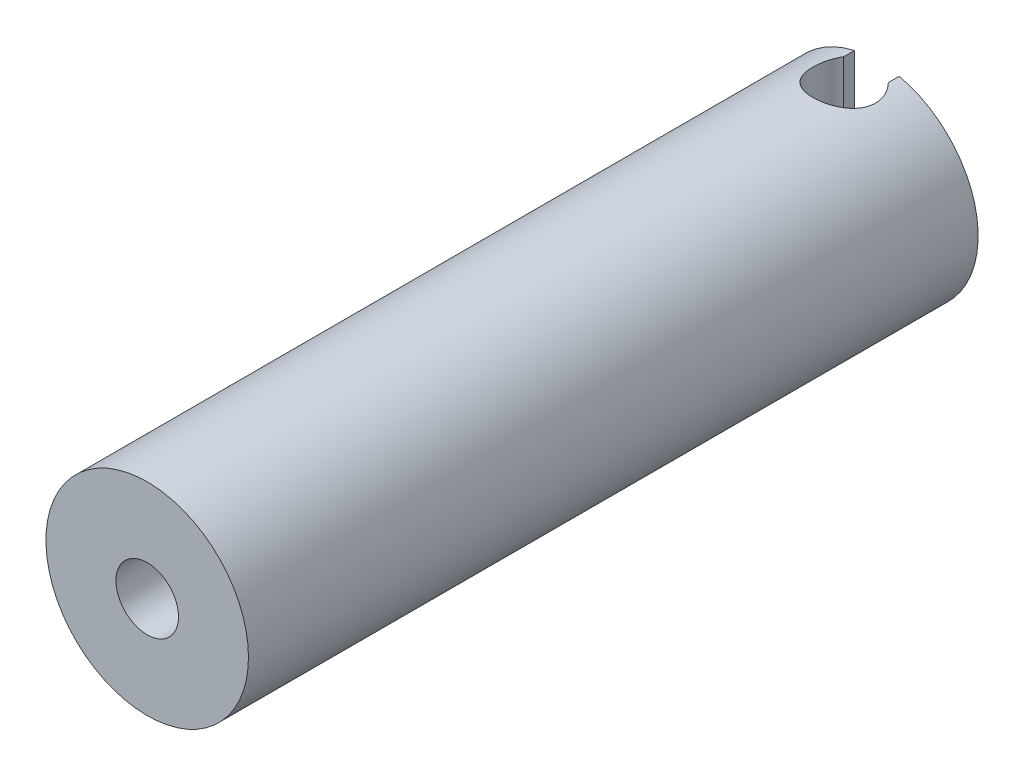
ISO-10303-21;
HEADER;
FILE_DESCRIPTION(('STEP AP214'),'2;1');
FILE_NAME('part.step','',(''),(''),'','','');
FILE_SCHEMA(('AUTOMOTIVE_DESIGN { 1 0 10303 214 1 1 1 1 }'));
ENDSEC;
DATA;
#1=APPLICATION_CONTEXT('core data for automotive mechanical design processes');
#2=APPLICATION_PROTOCOL_DEFINITION('international standard','automotive_design',2000,#1);
#3=PRODUCT_CONTEXT('',#1,'mechanical');
#4=PRODUCT('Part','Part','',(#3));
#5=PRODUCT_RELATED_PRODUCT_CATEGORY('part','',(#4));
#6=PRODUCT_DEFINITION_FORMATION('','',#4);
#7=PRODUCT_DEFINITION_CONTEXT('part definition',#1,'design');
#8=PRODUCT_DEFINITION('design','',#6,#7);
#9=PRODUCT_DEFINITION_SHAPE('','',#8);
#10=(LENGTH_UNIT() NAMED_UNIT(*) SI_UNIT(.MILLI.,.METRE.));
#11=(NAMED_UNIT(*) PLANE_ANGLE_UNIT() SI_UNIT($,.RADIAN.));
#12=(NAMED_UNIT(*) SI_UNIT($,.STERADIAN.) SOLID_ANGLE_UNIT());
#13=UNCERTAINTY_MEASURE_WITH_UNIT(LENGTH_MEASURE(1.E-05),#10,'distance_accuracy_value','');
#14=(GEOMETRIC_REPRESENTATION_CONTEXT(3) GLOBAL_UNCERTAINTY_ASSIGNED_CONTEXT((#13)) GLOBAL_UNIT_ASSIGNED_CONTEXT((#10,
#11,#12)) REPRESENTATION_CONTEXT('',''));
#15=CARTESIAN_POINT('',(0.,0.,0.));
#16=DIRECTION('',(0.,0.,1.));
#17=DIRECTION('',(1.,0.,0.));
#18=AXIS2_PLACEMENT_3D('',#15,#16,#17);
#19=CARTESIAN_POINT('',(0.,0.,0.));
#20=DIRECTION('',(0.,0.,1.));
#21=DIRECTION('',(1.,0.,0.));
#22=AXIS2_PLACEMENT_3D('',#19,#20,#21);
#23=PLANE('',#22);
#24=CARTESIAN_POINT('',(0.,0.,0.));
#25=DIRECTION('',(0.,0.,1.));
#26=DIRECTION('',(1.,0.,0.));
#27=AXIS2_PLACEMENT_3D('',#24,#25,#26);
#28=CIRCLE('',#27,6.8);
#29=CARTESIAN_POINT('',(1.5,-6.63249575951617,0.));
#30=VERTEX_POINT('',#29);
#31=CARTESIAN_POINT('',(1.5,6.63249575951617,0.));
#32=VERTEX_POINT('',#31);
#33=EDGE_CURVE('E134',#30,#32,#28,.T.);
#34=ORIENTED_EDGE('',*,*,#33,.F.);
#35=DIRECTION('',(0.,-1.,0.));
#36=VECTOR('',#35,1.);
#37=CARTESIAN_POINT('',(1.5,-8.51038839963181,0.));
#38=LINE('',#37,#36);
#39=CARTESIAN_POINT('',(1.5,-1.46969384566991,0.));
#40=VERTEX_POINT('',#39);
#41=EDGE_CURVE('E202',#40,#30,#38,.T.);
#42=ORIENTED_EDGE('',*,*,#41,.F.);
#43=CARTESIAN_POINT('',(0.,0.,0.));
#44=DIRECTION('',(0.,0.,1.));
#45=DIRECTION('',(1.,0.,0.));
#46=AXIS2_PLACEMENT_3D('',#43,#44,#45);
#47=CIRCLE('',#46,2.1);
#48=CARTESIAN_POINT('',(1.5,1.46969384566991,0.));
#49=VERTEX_POINT('',#48);
#50=EDGE_CURVE('E135',#40,#49,#47,.T.);
#51=ORIENTED_EDGE('',*,*,#50,.T.);
#52=EDGE_CURVE('E201',#32,#49,#38,.T.);
#53=ORIENTED_EDGE('',*,*,#52,.F.);
#54=EDGE_LOOP('',(#34,#42,#51,#53));
#55=FACE_BOUND('',#54,.T.);
#56=ADVANCED_FACE('F33',(#55),#23,.F.);
#57=CARTESIAN_POINT('',(0.,0.,0.));
#58=DIRECTION('',(0.,0.,1.));
#59=DIRECTION('',(1.,0.,0.));
#60=AXIS2_PLACEMENT_3D('',#57,#58,#59);
#61=CYLINDRICAL_SURFACE('',#60,2.1);
#62=CARTESIAN_POINT('',(0.,0.,2.2));
#63=DIRECTION('',(0.,0.707106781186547,0.707106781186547));
#64=DIRECTION('',(0.,-0.707106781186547,0.707106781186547));
#65=AXIS2_PLACEMENT_3D('',#62,#63,#64);
#66=ELLIPSE('',#65,2.9698484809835,2.1);
#67=CARTESIAN_POINT('',(1.84661853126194,1.,1.2));
#68=VERTEX_POINT('',#67);
#69=CARTESIAN_POINT('',(1.5,1.46969384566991,0.730306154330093));
#70=VERTEX_POINT('',#69);
#71=EDGE_CURVE('E161',#68,#70,#66,.T.);
#72=ORIENTED_EDGE('',*,*,#71,.T.);
#73=DIRECTION('',(0.,0.,1.));
#74=VECTOR('',#73,1.);
#75=CARTESIAN_POINT('',(1.5,1.46969384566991,0.));
#76=LINE('',#75,#74);
#77=EDGE_CURVE('E179',#70,#49,#76,.F.);
#78=ORIENTED_EDGE('',*,*,#77,.T.);
#79=ORIENTED_EDGE('',*,*,#50,.F.);
#80=DIRECTION('',(0.,0.,1.));
#81=VECTOR('',#80,1.);
#82=CARTESIAN_POINT('',(1.5,-1.46969384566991,0.));
#83=LINE('',#82,#81);
#84=CARTESIAN_POINT('',(1.5,-1.46969384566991,1.5));
#85=VERTEX_POINT('',#84);
#86=EDGE_CURVE('E189',#40,#85,#83,.T.);
#87=ORIENTED_EDGE('',*,*,#86,.T.);
#88=CARTESIAN_POINT('',(0.,0.,1.5));
#89=DIRECTION('',(0.,0.,-1.));
#90=DIRECTION('',(-1.,0.,0.));
#91=AXIS2_PLACEMENT_3D('',#88,#89,#90);
#92=CIRCLE('',#91,2.1);
#93=CARTESIAN_POINT('',(-1.5,-1.46969384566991,1.5));
#94=VERTEX_POINT('',#93);
#95=EDGE_CURVE('E129',#94,#85,#92,.F.);
#96=ORIENTED_EDGE('',*,*,#95,.F.);
#97=DIRECTION('',(0.,0.,1.));
#98=VECTOR('',#97,1.);
#99=CARTESIAN_POINT('',(-1.5,-1.46969384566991,0.));
#100=LINE('',#99,#98);
#101=CARTESIAN_POINT('',(-1.5,-1.46969384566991,0.));
#102=VERTEX_POINT('',#101);
#103=EDGE_CURVE('E111',#94,#102,#100,.F.);
#104=ORIENTED_EDGE('',*,*,#103,.T.);
#105=CARTESIAN_POINT('',(-1.5,1.46969384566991,0.));
#106=VERTEX_POINT('',#105);
#107=EDGE_CURVE('E127',#106,#102,#47,.T.);
#108=ORIENTED_EDGE('',*,*,#107,.F.);
#109=DIRECTION('',(0.,0.,1.));
#110=VECTOR('',#109,1.);
#111=CARTESIAN_POINT('',(-1.5,1.46969384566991,0.));
#112=LINE('',#111,#110);
#113=CARTESIAN_POINT('',(-1.5,1.46969384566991,0.730306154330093));
#114=VERTEX_POINT('',#113);
#115=EDGE_CURVE('E197',#106,#114,#112,.T.);
#116=ORIENTED_EDGE('',*,*,#115,.T.);
#117=CARTESIAN_POINT('',(-1.84661853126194,1.,1.2));
#118=VERTEX_POINT('',#117);
#119=EDGE_CURVE('E160',#114,#118,#66,.T.);
#120=ORIENTED_EDGE('',*,*,#119,.T.);
#121=DIRECTION('',(0.,0.,1.));
#122=VECTOR('',#121,1.);
#123=CARTESIAN_POINT('',(-1.84661853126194,1.,0.));
#124=LINE('',#123,#122);
#125=CARTESIAN_POINT('',(-1.84661853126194,1.,3.2));
#126=VERTEX_POINT('',#125);
#127=EDGE_CURVE('E163',#126,#118,#124,.F.);
#128=ORIENTED_EDGE('',*,*,#127,.F.);
#129=CARTESIAN_POINT('',(0.,0.,2.2));
#130=DIRECTION('',(0.,-0.707106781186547,0.707106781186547));
#131=DIRECTION('',(0.,0.707106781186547,0.707106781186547));
#132=AXIS2_PLACEMENT_3D('',#129,#130,#131);
#133=ELLIPSE('',#132,2.9698484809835,2.1);
#134=CARTESIAN_POINT('',(1.84661853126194,1.,3.2));
#135=VERTEX_POINT('',#134);
#136=EDGE_CURVE('E157',#126,#135,#133,.F.);
#137=ORIENTED_EDGE('',*,*,#136,.T.);
#138=DIRECTION('',(0.,0.,1.));
#139=VECTOR('',#138,1.);
#140=CARTESIAN_POINT('',(1.84661853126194,1.,0.));
#141=LINE('',#140,#139);
#142=EDGE_CURVE('E154',#68,#135,#141,.T.);
#143=ORIENTED_EDGE('',*,*,#142,.F.);
#144=EDGE_LOOP('',(#72,#78,#79,#87,#96,#104,#108,#116,#120,#128,#137,#143));
#145=FACE_BOUND('',#144,.T.);
#146=CARTESIAN_POINT('',(0.,0.,49.));
#147=DIRECTION('',(0.,0.,1.));
#148=DIRECTION('',(1.,0.,0.));
#149=AXIS2_PLACEMENT_3D('',#146,#147,#148);
#150=CIRCLE('',#149,2.1);
#151=CARTESIAN_POINT('',(2.1,0.,49.));
#152=VERTEX_POINT('',#151);
#153=EDGE_CURVE('E141',#152,#152,#150,.T.);
#154=ORIENTED_EDGE('',*,*,#153,.T.);
#155=EDGE_LOOP('',(#154));
#156=FACE_BOUND('',#155,.T.);
#157=ADVANCED_FACE('F124',(#145,#156),#61,.F.);
#158=CARTESIAN_POINT('',(0.,0.,49.));
#159=DIRECTION('',(0.,0.,-1.));
#160=DIRECTION('',(-1.,0.,0.));
#161=AXIS2_PLACEMENT_3D('',#158,#159,#160);
#162=CYLINDRICAL_SURFACE('',#161,6.8);
#163=ORIENTED_EDGE('',*,*,#33,.T.);
#164=DIRECTION('',(0.,0.,-1.));
#165=VECTOR('',#164,1.);
#166=CARTESIAN_POINT('',(1.5,6.63249575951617,49.));
#167=LINE('',#166,#165);
#168=CARTESIAN_POINT('',(1.5,6.63249575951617,0.730306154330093));
#169=VERTEX_POINT('',#168);
#170=EDGE_CURVE('E130',#32,#169,#167,.F.);
#171=ORIENTED_EDGE('',*,*,#170,.T.);
#172=CARTESIAN_POINT('',(0.,6.8,4.3));
#173=CARTESIAN_POINT('',(-0.115045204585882,6.79999929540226,4.29999905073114));
#174=CARTESIAN_POINT('',(-0.23010014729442,6.79705276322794,4.29051493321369));
#175=CARTESIAN_POINT('',(-0.456849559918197,6.78558689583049,4.25292567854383));
#176=CARTESIAN_POINT('',(-0.568543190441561,6.77706618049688,4.22481592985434));
#177=CARTESIAN_POINT('',(-0.785267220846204,6.75538361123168,4.15101070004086));
#178=CARTESIAN_POINT('',(-0.890307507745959,6.74222884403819,4.10534206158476));
#179=CARTESIAN_POINT('',(-1.09123950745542,6.7126391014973,3.99782839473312));
#180=CARTESIAN_POINT('',(-1.18712984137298,6.69620363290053,3.935980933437));
#181=CARTESIAN_POINT('',(-1.36993996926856,6.66124375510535,3.79589594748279));
#182=CARTESIAN_POINT('',(-1.45654417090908,6.64267463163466,3.71725777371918));
#183=CARTESIAN_POINT('',(-1.61556878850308,6.60580158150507,3.54667692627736));
#184=CARTESIAN_POINT('',(-1.68798664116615,6.58749770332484,3.45473185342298));
#185=CARTESIAN_POINT('',(-1.81827902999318,6.55274979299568,3.2574335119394));
#186=CARTESIAN_POINT('',(-1.87576201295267,6.53636106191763,3.15181100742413));
#187=CARTESIAN_POINT('',(-1.97201906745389,6.5079703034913,2.93181031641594));
#188=CARTESIAN_POINT('',(-2.01079793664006,6.49596715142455,2.81743438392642));
#189=CARTESIAN_POINT('',(-2.06739617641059,6.47817378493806,2.58672968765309));
#190=CARTESIAN_POINT('',(-2.08579990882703,6.47221079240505,2.47055797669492));
#191=CARTESIAN_POINT('',(-2.10295083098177,6.46665960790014,2.23663454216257));
#192=CARTESIAN_POINT('',(-2.10170310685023,6.46706976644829,2.11888323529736));
#193=CARTESIAN_POINT('',(-2.08004416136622,6.47406584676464,1.88995240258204));
#194=CARTESIAN_POINT('',(-2.06037255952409,6.48041340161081,1.77869439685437));
#195=CARTESIAN_POINT('',(-2.0036221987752,6.49818230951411,1.56114212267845));
#196=CARTESIAN_POINT('',(-1.96654162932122,6.50960419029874,1.45484837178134));
#197=CARTESIAN_POINT('',(-1.87549693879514,6.53641971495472,1.24846594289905));
#198=CARTESIAN_POINT('',(-1.82129830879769,6.55186797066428,1.14848811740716));
#199=CARTESIAN_POINT('',(-1.69771889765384,6.58497022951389,0.958802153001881));
#200=CARTESIAN_POINT('',(-1.62833425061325,6.60262479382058,0.869096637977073));
#201=CARTESIAN_POINT('',(-1.47270994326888,6.63910982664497,0.698316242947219));
#202=CARTESIAN_POINT('',(-1.38585873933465,6.65795770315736,0.61780134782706));
#203=CARTESIAN_POINT('',(-1.19965225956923,6.69401341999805,0.47234474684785));
#204=CARTESIAN_POINT('',(-1.1002961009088,6.71122114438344,0.407404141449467));
#205=CARTESIAN_POINT('',(-0.890839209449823,6.74223122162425,0.294571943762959));
#206=CARTESIAN_POINT('',(-0.780663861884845,6.75600721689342,0.246811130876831));
#207=CARTESIAN_POINT('',(-0.553318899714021,6.77841150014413,0.170665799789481));
#208=CARTESIAN_POINT('',(-0.436151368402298,6.78704131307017,0.142275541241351));
#209=CARTESIAN_POINT('',(-0.202903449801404,6.79793674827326,0.106624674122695));
#210=CARTESIAN_POINT('',(-0.0869494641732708,6.80043066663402,0.0986057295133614));
#211=CARTESIAN_POINT('',(0.144658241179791,6.79944689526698,0.101790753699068));
#212=CARTESIAN_POINT('',(0.260312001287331,6.79597005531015,0.112991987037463));
#213=CARTESIAN_POINT('',(0.485129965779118,6.7835852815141,0.153689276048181));
#214=CARTESIAN_POINT('',(0.594383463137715,6.77481067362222,0.182736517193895));
#215=CARTESIAN_POINT('',(0.806437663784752,6.75285358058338,0.257755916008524));
#216=CARTESIAN_POINT('',(0.909237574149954,6.73967055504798,0.303730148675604));
#217=CARTESIAN_POINT('',(1.10821190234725,6.70986117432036,0.412534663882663));
#218=CARTESIAN_POINT('',(1.20416786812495,6.69315971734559,0.47574329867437));
#219=CARTESIAN_POINT('',(1.38436645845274,6.65822560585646,0.616766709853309));
#220=CARTESIAN_POINT('',(1.46860596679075,6.63999254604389,0.694585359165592));
#221=CARTESIAN_POINT('',(1.62635737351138,6.60316463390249,0.866185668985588));
#222=CARTESIAN_POINT('',(1.69932903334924,6.58458302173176,0.960467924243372));
#223=CARTESIAN_POINT('',(1.82846051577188,6.54990215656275,1.16034342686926));
#224=CARTESIAN_POINT('',(1.88462066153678,6.53380285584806,1.26593645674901));
#225=CARTESIAN_POINT('',(1.97817430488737,6.50609035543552,1.48518048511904));
#226=CARTESIAN_POINT('',(2.0156452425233,6.49445869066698,1.59879596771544));
#227=CARTESIAN_POINT('',(2.07079630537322,6.47708691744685,1.83115481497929));
#228=CARTESIAN_POINT('',(2.08848373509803,6.47134463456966,1.94989627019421));
#229=CARTESIAN_POINT('',(2.10304935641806,6.4666247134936,2.18349945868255));
#230=CARTESIAN_POINT('',(2.10081211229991,6.4673595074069,2.29830092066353));
#231=CARTESIAN_POINT('',(2.07772014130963,6.47481450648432,2.52580779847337));
#232=CARTESIAN_POINT('',(2.05686624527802,6.48153444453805,2.63851330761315));
#233=CARTESIAN_POINT('',(1.99771889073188,6.50000398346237,2.8570877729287));
#234=CARTESIAN_POINT('',(1.95967291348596,6.51168207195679,2.96303019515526));
#235=CARTESIAN_POINT('',(1.86741553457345,6.53873531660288,3.16711257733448));
#236=CARTESIAN_POINT('',(1.81320090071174,6.55411121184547,3.26525097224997));
#237=CARTESIAN_POINT('',(1.68771407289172,6.587562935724,3.45501035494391));
#238=CARTESIAN_POINT('',(1.61586775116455,6.60571965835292,3.54623738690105));
#239=CARTESIAN_POINT('',(1.45817412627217,6.64230912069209,3.7156267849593));
#240=CARTESIAN_POINT('',(1.37232311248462,6.66074193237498,3.79378567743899));
#241=CARTESIAN_POINT('',(1.18578994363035,6.69650574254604,3.93729083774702));
#242=CARTESIAN_POINT('',(1.08472467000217,6.71378347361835,4.00215383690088));
#243=CARTESIAN_POINT('',(0.872590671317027,6.74463087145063,4.11388123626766));
#244=CARTESIAN_POINT('',(0.76152612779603,6.7582020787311,4.16075311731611));
#245=CARTESIAN_POINT('',(0.543019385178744,6.77908974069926,4.23152451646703));
#246=CARTESIAN_POINT('',(0.436171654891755,6.78686399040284,4.25713017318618));
#247=CARTESIAN_POINT('',(0.219551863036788,6.79731896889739,4.29136674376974));
#248=CARTESIAN_POINT('',(0.109780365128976,6.80000067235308,4.30000090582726));
#249=CARTESIAN_POINT('',(0.,6.8,4.3));
#250=B_SPLINE_CURVE_WITH_KNOTS('',3,(#172,#173,#174,#175,#176,#177,#178,#179,#180,#181,#182,
#183,#184,#185,#186,#187,#188,#189,#190,#191,#192,#193,#194,#195,#196,#197,#198,#199,#200,#201,
#202,#203,#204,#205,#206,#207,#208,#209,#210,#211,#212,#213,#214,#215,#216,#217,#218,#219,#220,
#221,#222,#223,#224,#225,#226,#227,#228,#229,#230,#231,#232,#233,#234,#235,#236,#237,#238,#239,
#240,#241,#242,#243,#244,#245,#246,#247,#248,#249),.UNSPECIFIED.,.T.,.F.,(4,2,2,2,2,2,2,2,2,2,2,
2,2,2,2,2,2,2,2,2,2,2,2,2,2,2,2,2,2,2,2,2,2,2,2,2,2,2,4),(0.,0.344732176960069,
0.689549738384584,1.03384225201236,1.37818656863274,1.73191282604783,2.0857029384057,
2.4479997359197,2.81020355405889,3.1617261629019,3.51315779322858,3.85105975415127,
4.18899686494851,4.53178050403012,4.87465150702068,5.23274480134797,5.59086339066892,
5.95165314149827,6.31233592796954,6.65938109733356,7.00637687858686,7.34498420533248,
7.68363305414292,8.03041613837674,8.37729128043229,8.73756867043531,9.09783913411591,
9.45660412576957,9.8152366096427,10.1580296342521,10.5008073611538,10.8388006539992,
11.1768615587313,11.5278793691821,11.8789903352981,12.241203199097,12.6032652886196,
12.9322843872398,13.2612405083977),.UNSPECIFIED.);
#251=CARTESIAN_POINT('',(-1.5,6.63249575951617,0.730306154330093));
#252=VERTEX_POINT('',#251);
#253=EDGE_CURVE('E144',#169,#252,#250,.T.);
#254=ORIENTED_EDGE('',*,*,#253,.T.);
#255=DIRECTION('',(0.,0.,-1.));
#256=VECTOR('',#255,1.);
#257=CARTESIAN_POINT('',(-1.5,6.63249575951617,49.));
#258=LINE('',#257,#256);
#259=CARTESIAN_POINT('',(-1.5,6.63249575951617,0.));
#260=VERTEX_POINT('',#259);
#261=EDGE_CURVE('E57',#252,#260,#258,.T.);
#262=ORIENTED_EDGE('',*,*,#261,.T.);
#263=CARTESIAN_POINT('',(-1.5,-6.63249575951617,0.));
#264=VERTEX_POINT('',#263);
#265=EDGE_CURVE('E138',#260,#264,#28,.T.);
#266=ORIENTED_EDGE('',*,*,#265,.T.);
#267=DIRECTION('',(0.,0.,-1.));
#268=VECTOR('',#267,1.);
#269=CARTESIAN_POINT('',(-1.5,-6.63249575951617,49.));
#270=LINE('',#269,#268);
#271=CARTESIAN_POINT('',(-1.5,-6.63249575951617,1.5));
#272=VERTEX_POINT('',#271);
#273=EDGE_CURVE('E49',#264,#272,#270,.F.);
#274=ORIENTED_EDGE('',*,*,#273,.T.);
#275=CARTESIAN_POINT('',(0.,0.,1.5));
#276=DIRECTION('',(0.,0.,-1.));
#277=DIRECTION('',(-1.,0.,0.));
#278=AXIS2_PLACEMENT_3D('',#275,#276,#277);
#279=CIRCLE('',#278,6.8);
#280=CARTESIAN_POINT('',(1.5,-6.63249575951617,1.5));
#281=VERTEX_POINT('',#280);
#282=EDGE_CURVE('E11',#281,#272,#279,.T.);
#283=ORIENTED_EDGE('',*,*,#282,.F.);
#284=DIRECTION('',(0.,0.,-1.));
#285=VECTOR('',#284,1.);
#286=CARTESIAN_POINT('',(1.5,-6.63249575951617,49.));
#287=LINE('',#286,#285);
#288=EDGE_CURVE('E191',#281,#30,#287,.T.);
#289=ORIENTED_EDGE('',*,*,#288,.T.);
#290=EDGE_LOOP('',(#163,#171,#254,#262,#266,#274,#283,#289));
#291=FACE_BOUND('',#290,.T.);
#292=CARTESIAN_POINT('',(0.,0.,49.));
#293=DIRECTION('',(0.,0.,1.));
#294=DIRECTION('',(1.,0.,0.));
#295=AXIS2_PLACEMENT_3D('',#292,#293,#294);
#296=CIRCLE('',#295,6.8);
#297=CARTESIAN_POINT('',(6.8,0.,49.));
#298=VERTEX_POINT('',#297);
#299=EDGE_CURVE('E152',#298,#298,#296,.T.);
#300=ORIENTED_EDGE('',*,*,#299,.F.);
#301=EDGE_LOOP('',(#300));
#302=FACE_BOUND('',#301,.T.);
#303=ADVANCED_FACE('F35',(#291,#302),#162,.T.);
#304=CARTESIAN_POINT('',(0.,0.,49.));
#305=DIRECTION('',(0.,0.,1.));
#306=DIRECTION('',(1.,0.,0.));
#307=AXIS2_PLACEMENT_3D('',#304,#305,#306);
#308=PLANE('',#307);
#309=ORIENTED_EDGE('',*,*,#153,.F.);
#310=EDGE_LOOP('',(#309));
#311=FACE_BOUND('',#310,.T.);
#312=ORIENTED_EDGE('',*,*,#299,.T.);
#313=EDGE_LOOP('',(#312));
#314=FACE_BOUND('',#313,.T.);
#315=ADVANCED_FACE('F237',(#311,#314),#308,.T.);
#316=ORIENTED_EDGE('',*,*,#265,.F.);
#317=DIRECTION('',(0.,1.,0.));
#318=VECTOR('',#317,1.);
#319=CARTESIAN_POINT('',(-1.5,-8.51038839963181,0.));
#320=LINE('',#319,#318);
#321=EDGE_CURVE('E118',#106,#260,#320,.T.);
#322=ORIENTED_EDGE('',*,*,#321,.F.);
#323=ORIENTED_EDGE('',*,*,#107,.T.);
#324=EDGE_CURVE('E108',#264,#102,#320,.T.);
#325=ORIENTED_EDGE('',*,*,#324,.F.);
#326=EDGE_LOOP('',(#316,#322,#323,#325));
#327=FACE_BOUND('',#326,.T.);
#328=ADVANCED_FACE('F133',(#327),#23,.F.);
#329=CARTESIAN_POINT('',(0.,1.,2.2));
#330=DIRECTION('',(0.,1.,0.));
#331=DIRECTION('',(0.,0.,1.));
#332=AXIS2_PLACEMENT_3D('',#329,#330,#331);
#333=CYLINDRICAL_SURFACE('',#332,2.1);
#334=ORIENTED_EDGE('',*,*,#253,.F.);
#335=DIRECTION('',(0.,1.,0.));
#336=VECTOR('',#335,1.);
#337=CARTESIAN_POINT('',(1.5,1.,0.730306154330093));
#338=LINE('',#337,#336);
#339=EDGE_CURVE('E42',#169,#70,#338,.F.);
#340=ORIENTED_EDGE('',*,*,#339,.T.);
#341=ORIENTED_EDGE('',*,*,#71,.F.);
#342=CARTESIAN_POINT('',(0.,1.,2.2));
#343=DIRECTION('',(0.,1.,0.));
#344=DIRECTION('',(0.,0.,1.));
#345=AXIS2_PLACEMENT_3D('',#342,#343,#344);
#346=CIRCLE('',#345,2.1);
#347=EDGE_CURVE('E183',#135,#68,#346,.T.);
#348=ORIENTED_EDGE('',*,*,#347,.F.);
#349=ORIENTED_EDGE('',*,*,#136,.F.);
#350=EDGE_CURVE('E186',#118,#126,#346,.T.);
#351=ORIENTED_EDGE('',*,*,#350,.F.);
#352=ORIENTED_EDGE('',*,*,#119,.F.);
#353=DIRECTION('',(0.,1.,0.));
#354=VECTOR('',#353,1.);
#355=CARTESIAN_POINT('',(-1.5,1.,0.730306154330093));
#356=LINE('',#355,#354);
#357=EDGE_CURVE('E166',#114,#252,#356,.T.);
#358=ORIENTED_EDGE('',*,*,#357,.T.);
#359=EDGE_LOOP('',(#334,#340,#341,#348,#349,#351,#352,#358));
#360=FACE_BOUND('',#359,.T.);
#361=ADVANCED_FACE('F171',(#360),#333,.F.);
#362=CARTESIAN_POINT('',(0.,1.,2.2));
#363=DIRECTION('',(0.,1.,0.));
#364=DIRECTION('',(0.,0.,1.));
#365=AXIS2_PLACEMENT_3D('',#362,#363,#364);
#366=PLANE('',#365);
#367=ORIENTED_EDGE('',*,*,#127,.T.);
#368=ORIENTED_EDGE('',*,*,#350,.T.);
#369=EDGE_LOOP('',(#367,#368));
#370=FACE_BOUND('',#369,.T.);
#371=ADVANCED_FACE('F242',(#370),#366,.T.);
#372=ORIENTED_EDGE('',*,*,#142,.T.);
#373=ORIENTED_EDGE('',*,*,#347,.T.);
#374=EDGE_LOOP('',(#372,#373));
#375=FACE_BOUND('',#374,.T.);
#376=ADVANCED_FACE('F182',(#375),#366,.T.);
#377=CARTESIAN_POINT('',(-1.5,-8.51038839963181,1.5));
#378=DIRECTION('',(-1.,0.,0.));
#379=DIRECTION('',(0.,0.,1.));
#380=AXIS2_PLACEMENT_3D('',#377,#378,#379);
#381=PLANE('',#380);
#382=ORIENTED_EDGE('',*,*,#321,.T.);
#383=ORIENTED_EDGE('',*,*,#261,.F.);
#384=ORIENTED_EDGE('',*,*,#357,.F.);
#385=ORIENTED_EDGE('',*,*,#115,.F.);
#386=EDGE_LOOP('',(#382,#383,#384,#385));
#387=FACE_BOUND('',#386,.T.);
#388=ADVANCED_FACE('F226',(#387),#381,.F.);
#389=CARTESIAN_POINT('',(1.5,-8.51038839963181,1.5));
#390=DIRECTION('',(1.,0.,0.));
#391=DIRECTION('',(0.,0.,-1.));
#392=AXIS2_PLACEMENT_3D('',#389,#390,#391);
#393=PLANE('',#392);
#394=ORIENTED_EDGE('',*,*,#339,.F.);
#395=ORIENTED_EDGE('',*,*,#170,.F.);
#396=ORIENTED_EDGE('',*,*,#52,.T.);
#397=ORIENTED_EDGE('',*,*,#77,.F.);
#398=EDGE_LOOP('',(#394,#395,#396,#397));
#399=FACE_BOUND('',#398,.T.);
#400=ADVANCED_FACE('F215',(#399),#393,.F.);
#401=CARTESIAN_POINT('',(0.,0.,1.5));
#402=DIRECTION('',(0.,0.,-1.));
#403=DIRECTION('',(-1.,0.,0.));
#404=AXIS2_PLACEMENT_3D('',#401,#402,#403);
#405=PLANE('',#404);
#406=ORIENTED_EDGE('',*,*,#95,.T.);
#407=DIRECTION('',(0.,-1.,0.));
#408=VECTOR('',#407,1.);
#409=CARTESIAN_POINT('',(1.5,-8.51038839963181,1.5));
#410=LINE('',#409,#408);
#411=EDGE_CURVE('E117',#85,#281,#410,.T.);
#412=ORIENTED_EDGE('',*,*,#411,.T.);
#413=ORIENTED_EDGE('',*,*,#282,.T.);
#414=DIRECTION('',(0.,1.,0.));
#415=VECTOR('',#414,1.);
#416=CARTESIAN_POINT('',(-1.5,-8.51038839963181,1.5));
#417=LINE('',#416,#415);
#418=EDGE_CURVE('E199',#272,#94,#417,.T.);
#419=ORIENTED_EDGE('',*,*,#418,.T.);
#420=EDGE_LOOP('',(#406,#412,#413,#419));
#421=FACE_BOUND('',#420,.T.);
#422=ADVANCED_FACE('F209',(#421),#405,.T.);
#423=ORIENTED_EDGE('',*,*,#41,.T.);
#424=ORIENTED_EDGE('',*,*,#288,.F.);
#425=ORIENTED_EDGE('',*,*,#411,.F.);
#426=ORIENTED_EDGE('',*,*,#86,.F.);
#427=EDGE_LOOP('',(#423,#424,#425,#426));
#428=FACE_BOUND('',#427,.T.);
#429=ADVANCED_FACE('F218',(#428),#393,.F.);
#430=ORIENTED_EDGE('',*,*,#418,.F.);
#431=ORIENTED_EDGE('',*,*,#273,.F.);
#432=ORIENTED_EDGE('',*,*,#324,.T.);
#433=ORIENTED_EDGE('',*,*,#103,.F.);
#434=EDGE_LOOP('',(#430,#431,#432,#433));
#435=FACE_BOUND('',#434,.T.);
#436=ADVANCED_FACE('F110',(#435),#381,.F.);
#437=CLOSED_SHELL('',(#56,#157,#303,#315,#328,#361,#371,#376,#388,#400,#422,#429,#436));
#438=MANIFOLD_SOLID_BREP('B2',#437);
#439=ADVANCED_BREP_SHAPE_REPRESENTATION('',(#18,#438),#14);
#440=SHAPE_DEFINITION_REPRESENTATION(#9,#439);
ENDSEC;
END-ISO-10303-21;
